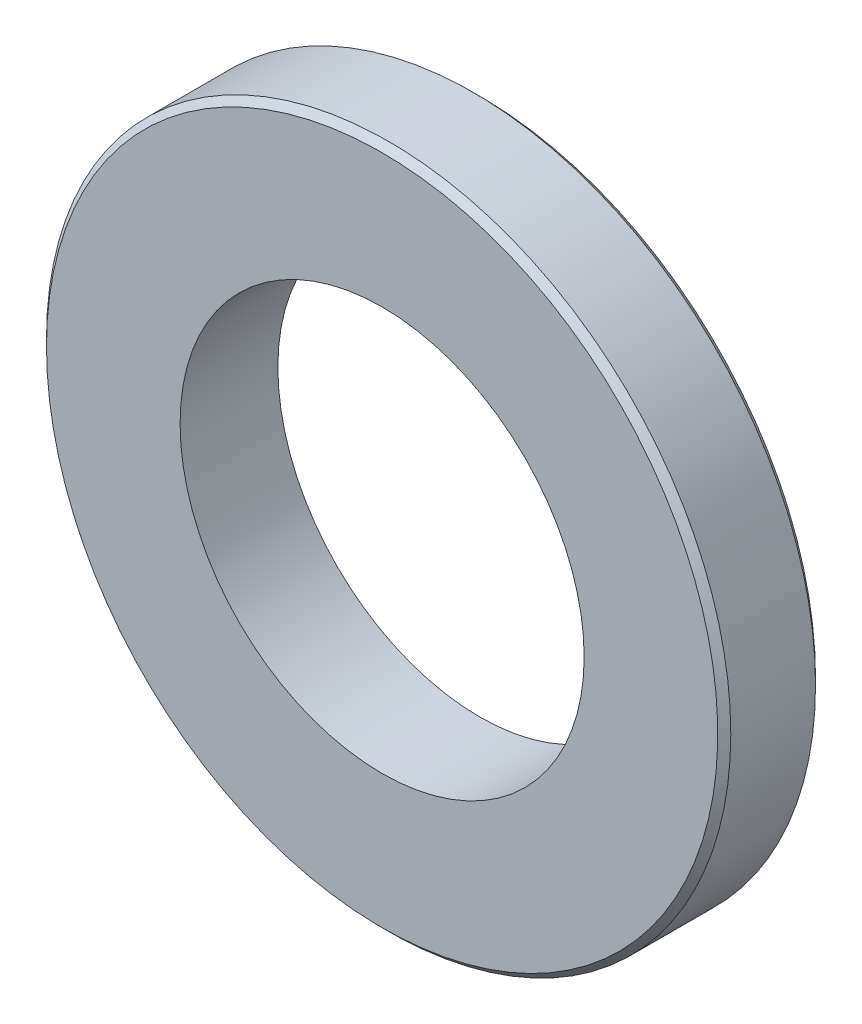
ISO-10303-21;
HEADER;
FILE_DESCRIPTION(('STEP AP214'),'2;1');
FILE_NAME('part.step','',(''),(''),'','','');
FILE_SCHEMA(('AUTOMOTIVE_DESIGN { 1 0 10303 214 1 1 1 1 }'));
ENDSEC;
DATA;
#1=APPLICATION_CONTEXT('core data for automotive mechanical design processes');
#2=APPLICATION_PROTOCOL_DEFINITION('international standard','automotive_design',2000,#1);
#3=PRODUCT_CONTEXT('',#1,'mechanical');
#4=PRODUCT('Part','Part','',(#3));
#5=PRODUCT_RELATED_PRODUCT_CATEGORY('part','',(#4));
#6=PRODUCT_DEFINITION_FORMATION('','',#4);
#7=PRODUCT_DEFINITION_CONTEXT('part definition',#1,'design');
#8=PRODUCT_DEFINITION('design','',#6,#7);
#9=PRODUCT_DEFINITION_SHAPE('','',#8);
#10=(LENGTH_UNIT() NAMED_UNIT(*) SI_UNIT(.MILLI.,.METRE.));
#11=(NAMED_UNIT(*) PLANE_ANGLE_UNIT() SI_UNIT($,.RADIAN.));
#12=(NAMED_UNIT(*) SI_UNIT($,.STERADIAN.) SOLID_ANGLE_UNIT());
#13=UNCERTAINTY_MEASURE_WITH_UNIT(LENGTH_MEASURE(1.E-05),#10,'distance_accuracy_value','');
#14=(GEOMETRIC_REPRESENTATION_CONTEXT(3) GLOBAL_UNCERTAINTY_ASSIGNED_CONTEXT((#13)) GLOBAL_UNIT_ASSIGNED_CONTEXT((#10,
#11,#12)) REPRESENTATION_CONTEXT('',''));
#15=CARTESIAN_POINT('',(0.,0.,0.));
#16=DIRECTION('',(0.,0.,1.));
#17=DIRECTION('',(1.,0.,0.));
#18=AXIS2_PLACEMENT_3D('',#15,#16,#17);
#19=CARTESIAN_POINT('',(0.,6.66133814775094E-13,1.50000000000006));
#20=DIRECTION('',(0.,0.,0.999999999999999));
#21=DIRECTION('',(0.999999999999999,0.,0.));
#22=AXIS2_PLACEMENT_3D('',#19,#20,#21);
#23=PLANE('',#22);
#24=CARTESIAN_POINT('',(0.,6.66133814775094E-13,1.50000000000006));
#25=DIRECTION('',(0.,0.,0.999999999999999));
#26=DIRECTION('',(0.999999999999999,0.,0.));
#27=AXIS2_PLACEMENT_3D('',#24,#25,#26);
#28=CIRCLE('',#27,5.15);
#29=CARTESIAN_POINT('',(-5.14999999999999,6.65847932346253E-13,1.50000000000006));
#30=VERTEX_POINT('',#29);
#31=EDGE_CURVE('E51',#30,#30,#28,.T.);
#32=ORIENTED_EDGE('',*,*,#31,.T.);
#33=EDGE_LOOP('',(#32));
#34=FACE_BOUND('',#33,.T.);
#35=CARTESIAN_POINT('',(0.,6.66133814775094E-13,1.50000000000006));
#36=DIRECTION('',(0.,0.,0.999999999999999));
#37=DIRECTION('',(0.999999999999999,0.,0.));
#38=AXIS2_PLACEMENT_3D('',#35,#36,#37);
#39=CIRCLE('',#38,3.1);
#40=CARTESIAN_POINT('',(-3.1,6.65961730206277E-13,1.50000000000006));
#41=VERTEX_POINT('',#40);
#42=EDGE_CURVE('E56',#41,#41,#39,.T.);
#43=ORIENTED_EDGE('',*,*,#42,.F.);
#44=EDGE_LOOP('',(#43));
#45=FACE_BOUND('',#44,.T.);
#46=ADVANCED_FACE('F36',(#34,#45),#23,.T.);
#47=CARTESIAN_POINT('',(0.,6.66133814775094E-13,0.));
#48=DIRECTION('',(0.,0.,0.999999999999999));
#49=DIRECTION('',(0.999999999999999,0.,0.));
#50=AXIS2_PLACEMENT_3D('',#47,#48,#49);
#51=PLANE('',#50);
#52=CARTESIAN_POINT('',(0.,6.66133814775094E-13,0.));
#53=DIRECTION('',(0.,0.,0.999999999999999));
#54=DIRECTION('',(0.999999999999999,0.,0.));
#55=AXIS2_PLACEMENT_3D('',#52,#53,#54);
#56=CIRCLE('',#55,5.15);
#57=CARTESIAN_POINT('',(5.14999999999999,6.66419697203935E-13,0.));
#58=VERTEX_POINT('',#57);
#59=EDGE_CURVE('E10',#58,#58,#56,.F.);
#60=ORIENTED_EDGE('',*,*,#59,.T.);
#61=EDGE_LOOP('',(#60));
#62=FACE_BOUND('',#61,.T.);
#63=CARTESIAN_POINT('',(0.,6.66133814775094E-13,0.));
#64=DIRECTION('',(0.,0.,0.999999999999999));
#65=DIRECTION('',(0.999999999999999,0.,0.));
#66=AXIS2_PLACEMENT_3D('',#63,#64,#65);
#67=CIRCLE('',#66,3.1);
#68=CARTESIAN_POINT('',(-3.1,6.65961730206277E-13,0.));
#69=VERTEX_POINT('',#68);
#70=EDGE_CURVE('E59',#69,#69,#67,.T.);
#71=ORIENTED_EDGE('',*,*,#70,.T.);
#72=EDGE_LOOP('',(#71));
#73=FACE_BOUND('',#72,.T.);
#74=ADVANCED_FACE('F63',(#62,#73),#51,.F.);
#75=CARTESIAN_POINT('',(0.,6.66133814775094E-13,1.50000000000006));
#76=DIRECTION('',(0.,0.,-0.999999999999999));
#77=DIRECTION('',(-0.999999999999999,0.,0.));
#78=AXIS2_PLACEMENT_3D('',#75,#76,#77);
#79=CYLINDRICAL_SURFACE('',#78,5.25);
#80=CARTESIAN_POINT('',(0.,6.66133814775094E-13,1.40000000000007));
#81=DIRECTION('',(0.,0.,0.999999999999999));
#82=DIRECTION('',(0.999999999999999,0.,0.));
#83=AXIS2_PLACEMENT_3D('',#80,#81,#82);
#84=CIRCLE('',#83,5.25);
#85=CARTESIAN_POINT('',(-5.25,6.6584238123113E-13,1.40000000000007));
#86=VERTEX_POINT('',#85);
#87=EDGE_CURVE('E43',#86,#86,#84,.F.);
#88=CARTESIAN_POINT('',(0.,6.66133814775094E-13,0.099999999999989));
#89=DIRECTION('',(0.,0.,0.999999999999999));
#90=DIRECTION('',(0.999999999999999,0.,0.));
#91=AXIS2_PLACEMENT_3D('',#88,#89,#90);
#92=CIRCLE('',#91,5.25);
#93=CARTESIAN_POINT('',(-5.25,6.6584238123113E-13,0.099999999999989));
#94=VERTEX_POINT('',#93);
#95=EDGE_CURVE('E47',#94,#94,#92,.T.);
#96=CARTESIAN_POINT('',(-5.25,6.6584238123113E-13,1.40000000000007));
#97=CARTESIAN_POINT('',(-5.25,6.6584238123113E-13,1.3864583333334));
#98=CARTESIAN_POINT('',(-5.25,6.6584238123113E-13,1.37291666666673));
#99=CARTESIAN_POINT('',(-5.25,6.6584238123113E-13,1.3458333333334));
#100=CARTESIAN_POINT('',(-5.25,6.6584238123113E-13,1.33229166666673));
#101=CARTESIAN_POINT('',(-5.25,6.6584238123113E-13,1.3052083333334));
#102=CARTESIAN_POINT('',(-5.25,6.6584238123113E-13,1.29166666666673));
#103=CARTESIAN_POINT('',(-5.25,6.6584238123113E-13,1.26458333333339));
#104=CARTESIAN_POINT('',(-5.25,6.6584238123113E-13,1.25104166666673));
#105=CARTESIAN_POINT('',(-5.25,6.6584238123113E-13,1.22395833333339));
#106=CARTESIAN_POINT('',(-5.25,6.6584238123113E-13,1.21041666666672));
#107=CARTESIAN_POINT('',(-5.25,6.6584238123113E-13,1.18333333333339));
#108=CARTESIAN_POINT('',(-5.25,6.6584238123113E-13,1.16979166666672));
#109=CARTESIAN_POINT('',(-5.25,6.6584238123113E-13,1.14270833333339));
#110=CARTESIAN_POINT('',(-5.25,6.6584238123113E-13,1.12916666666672));
#111=CARTESIAN_POINT('',(-5.25,6.6584238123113E-13,1.10208333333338));
#112=CARTESIAN_POINT('',(-5.25,6.6584238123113E-13,1.08854166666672));
#113=CARTESIAN_POINT('',(-5.25,6.6584238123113E-13,1.06145833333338));
#114=CARTESIAN_POINT('',(-5.25,6.6584238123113E-13,1.04791666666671));
#115=CARTESIAN_POINT('',(-5.25,6.6584238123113E-13,1.02083333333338));
#116=CARTESIAN_POINT('',(-5.25,6.6584238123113E-13,1.00729166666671));
#117=CARTESIAN_POINT('',(-5.25,6.6584238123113E-13,0.980208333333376));
#118=CARTESIAN_POINT('',(-5.25,6.6584238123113E-13,0.966666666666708));
#119=CARTESIAN_POINT('',(-5.25,6.6584238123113E-13,0.939583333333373));
#120=CARTESIAN_POINT('',(-5.25,6.6584238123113E-13,0.926041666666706));
#121=CARTESIAN_POINT('',(-5.25,6.6584238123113E-13,0.898958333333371));
#122=CARTESIAN_POINT('',(-5.25,6.6584238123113E-13,0.885416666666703));
#123=CARTESIAN_POINT('',(-5.25,6.6584238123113E-13,0.858333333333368));
#124=CARTESIAN_POINT('',(-5.25,6.6584238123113E-13,0.844791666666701));
#125=CARTESIAN_POINT('',(-5.25,6.6584238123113E-13,0.817708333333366));
#126=CARTESIAN_POINT('',(-5.25,6.6584238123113E-13,0.804166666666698));
#127=CARTESIAN_POINT('',(-5.25,6.6584238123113E-13,0.777083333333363));
#128=CARTESIAN_POINT('',(-5.25,6.6584238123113E-13,0.763541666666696));
#129=CARTESIAN_POINT('',(-5.25,6.6584238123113E-13,0.736458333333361));
#130=CARTESIAN_POINT('',(-5.25,6.6584238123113E-13,0.722916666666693));
#131=CARTESIAN_POINT('',(-5.25,6.6584238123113E-13,0.695833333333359));
#132=CARTESIAN_POINT('',(-5.25,6.6584238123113E-13,0.682291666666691));
#133=CARTESIAN_POINT('',(-5.25,6.6584238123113E-13,0.655208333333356));
#134=CARTESIAN_POINT('',(-5.25,6.6584238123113E-13,0.641666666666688));
#135=CARTESIAN_POINT('',(-5.25,6.6584238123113E-13,0.614583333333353));
#136=CARTESIAN_POINT('',(-5.25,6.6584238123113E-13,0.601041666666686));
#137=CARTESIAN_POINT('',(-5.25,6.6584238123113E-13,0.573958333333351));
#138=CARTESIAN_POINT('',(-5.25,6.6584238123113E-13,0.560416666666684));
#139=CARTESIAN_POINT('',(-5.25,6.6584238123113E-13,0.533333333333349));
#140=CARTESIAN_POINT('',(-5.25,6.6584238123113E-13,0.519791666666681));
#141=CARTESIAN_POINT('',(-5.25,6.6584238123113E-13,0.492708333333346));
#142=CARTESIAN_POINT('',(-5.25,6.6584238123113E-13,0.479166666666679));
#143=CARTESIAN_POINT('',(-5.25,6.6584238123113E-13,0.452083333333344));
#144=CARTESIAN_POINT('',(-5.25,6.6584238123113E-13,0.438541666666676));
#145=CARTESIAN_POINT('',(-5.25,6.6584238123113E-13,0.411458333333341));
#146=CARTESIAN_POINT('',(-5.25,6.6584238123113E-13,0.397916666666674));
#147=CARTESIAN_POINT('',(-5.25,6.6584238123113E-13,0.370833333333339));
#148=CARTESIAN_POINT('',(-5.25,6.6584238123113E-13,0.357291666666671));
#149=CARTESIAN_POINT('',(-5.25,6.6584238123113E-13,0.330208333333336));
#150=CARTESIAN_POINT('',(-5.25,6.6584238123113E-13,0.316666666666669));
#151=CARTESIAN_POINT('',(-5.25,6.6584238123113E-13,0.289583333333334));
#152=CARTESIAN_POINT('',(-5.25,6.6584238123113E-13,0.276041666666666));
#153=CARTESIAN_POINT('',(-5.25,6.6584238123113E-13,0.248958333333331));
#154=CARTESIAN_POINT('',(-5.25,6.6584238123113E-13,0.235416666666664));
#155=CARTESIAN_POINT('',(-5.25,6.6584238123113E-13,0.208333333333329));
#156=CARTESIAN_POINT('',(-5.25,6.6584238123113E-13,0.194791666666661));
#157=CARTESIAN_POINT('',(-5.25,6.6584238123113E-13,0.167708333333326));
#158=CARTESIAN_POINT('',(-5.25,6.6584238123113E-13,0.154166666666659));
#159=CARTESIAN_POINT('',(-5.25,6.6584238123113E-13,0.127083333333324));
#160=CARTESIAN_POINT('',(-5.25,6.6584238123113E-13,0.113541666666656));
#161=CARTESIAN_POINT('',(-5.25,6.6584238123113E-13,0.099999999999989));
#162=B_SPLINE_CURVE_WITH_KNOTS('',3,(#96,#97,#98,#99,#100,#101,#102,#103,#104,#105,#106,#107,
#108,#109,#110,#111,#112,#113,#114,#115,#116,#117,#118,#119,#120,#121,#122,#123,#124,#125,#126,
#127,#128,#129,#130,#131,#132,#133,#134,#135,#136,#137,#138,#139,#140,#141,#142,#143,#144,#145,
#146,#147,#148,#149,#150,#151,#152,#153,#154,#155,#156,#157,#158,#159,#160,#161),.UNSPECIFIED.,
.F.,.F.,(4,2,2,2,2,2,2,2,2,2,2,2,2,2,2,2,2,2,2,2,2,2,2,2,2,2,2,2,2,2,2,2,4),(0.,
0.0406250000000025,0.0812500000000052,0.121875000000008,0.16250000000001,0.203125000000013,
0.243750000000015,0.284375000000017,0.32500000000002,0.365625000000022,0.406250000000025,
0.446875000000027,0.48750000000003,0.528125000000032,0.568750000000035,0.609375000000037,
0.65000000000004,0.690625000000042,0.731250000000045,0.771875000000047,0.81250000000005,
0.853125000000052,0.893750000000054,0.934375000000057,0.975000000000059,1.01562500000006,
1.05625000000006,1.09687500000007,1.13750000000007,1.17812500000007,1.21875000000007,
1.25937500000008,1.30000000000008),.UNSPECIFIED.);
#163=EDGE_CURVE('BSEAM38',#86,#94,#162,.T.);
#164=ORIENTED_EDGE('',*,*,#87,.T.);
#165=ORIENTED_EDGE('',*,*,#95,.T.);
#166=ORIENTED_EDGE('',*,*,#163,.T.);
#167=ORIENTED_EDGE('',*,*,#163,.F.);
#168=EDGE_LOOP('',(#164,#166,#165,#167));
#169=FACE_BOUND('',#168,.T.);
#170=ADVANCED_FACE('F38',(#169),#79,.T.);
#171=CARTESIAN_POINT('',(0.,6.66133814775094E-13,1.50000000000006));
#172=DIRECTION('',(0.,0.,-0.999999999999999));
#173=DIRECTION('',(-0.999999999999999,0.,0.));
#174=AXIS2_PLACEMENT_3D('',#171,#172,#173);
#175=CYLINDRICAL_SURFACE('',#174,3.1);
#176=CARTESIAN_POINT('',(-3.1,6.65961730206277E-13,1.50000000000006));
#177=CARTESIAN_POINT('',(-3.1,6.65961730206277E-13,1.48437500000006));
#178=CARTESIAN_POINT('',(-3.1,6.65961730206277E-13,1.46875000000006));
#179=CARTESIAN_POINT('',(-3.1,6.65961730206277E-13,1.43750000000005));
#180=CARTESIAN_POINT('',(-3.1,6.65961730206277E-13,1.42187500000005));
#181=CARTESIAN_POINT('',(-3.1,6.65961730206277E-13,1.39062500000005));
#182=CARTESIAN_POINT('',(-3.1,6.65961730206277E-13,1.37500000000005));
#183=CARTESIAN_POINT('',(-3.1,6.65961730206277E-13,1.34375000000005));
#184=CARTESIAN_POINT('',(-3.1,6.65961730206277E-13,1.32812500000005));
#185=CARTESIAN_POINT('',(-3.1,6.65961730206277E-13,1.29687500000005));
#186=CARTESIAN_POINT('',(-3.1,6.65961730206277E-13,1.28125000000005));
#187=CARTESIAN_POINT('',(-3.1,6.65961730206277E-13,1.25000000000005));
#188=CARTESIAN_POINT('',(-3.1,6.65961730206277E-13,1.23437500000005));
#189=CARTESIAN_POINT('',(-3.1,6.65961730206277E-13,1.20312500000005));
#190=CARTESIAN_POINT('',(-3.1,6.65961730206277E-13,1.18750000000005));
#191=CARTESIAN_POINT('',(-3.1,6.65961730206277E-13,1.15625000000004));
#192=CARTESIAN_POINT('',(-3.1,6.65961730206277E-13,1.14062500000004));
#193=CARTESIAN_POINT('',(-3.1,6.65961730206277E-13,1.10937500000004));
#194=CARTESIAN_POINT('',(-3.1,6.65961730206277E-13,1.09375000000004));
#195=CARTESIAN_POINT('',(-3.1,6.65961730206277E-13,1.06250000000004));
#196=CARTESIAN_POINT('',(-3.1,6.65961730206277E-13,1.04687500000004));
#197=CARTESIAN_POINT('',(-3.1,6.65961730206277E-13,1.01562500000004));
#198=CARTESIAN_POINT('',(-3.1,6.65961730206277E-13,1.00000000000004));
#199=CARTESIAN_POINT('',(-3.1,6.65961730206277E-13,0.968750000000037));
#200=CARTESIAN_POINT('',(-3.1,6.65961730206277E-13,0.953125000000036));
#201=CARTESIAN_POINT('',(-3.1,6.65961730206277E-13,0.921875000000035));
#202=CARTESIAN_POINT('',(-3.1,6.65961730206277E-13,0.906250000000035));
#203=CARTESIAN_POINT('',(-3.1,6.65961730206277E-13,0.875000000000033));
#204=CARTESIAN_POINT('',(-3.1,6.65961730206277E-13,0.859375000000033));
#205=CARTESIAN_POINT('',(-3.1,6.65961730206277E-13,0.828125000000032));
#206=CARTESIAN_POINT('',(-3.1,6.65961730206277E-13,0.812500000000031));
#207=CARTESIAN_POINT('',(-3.1,6.65961730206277E-13,0.78125000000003));
#208=CARTESIAN_POINT('',(-3.1,6.65961730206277E-13,0.765625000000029));
#209=CARTESIAN_POINT('',(-3.1,6.65961730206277E-13,0.734375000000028));
#210=CARTESIAN_POINT('',(-3.1,6.65961730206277E-13,0.718750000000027));
#211=CARTESIAN_POINT('',(-3.1,6.65961730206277E-13,0.687500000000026));
#212=CARTESIAN_POINT('',(-3.1,6.65961730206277E-13,0.671875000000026));
#213=CARTESIAN_POINT('',(-3.1,6.65961730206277E-13,0.640625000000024));
#214=CARTESIAN_POINT('',(-3.1,6.65961730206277E-13,0.625000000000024));
#215=CARTESIAN_POINT('',(-3.1,6.65961730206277E-13,0.593750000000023));
#216=CARTESIAN_POINT('',(-3.1,6.65961730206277E-13,0.578125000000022));
#217=CARTESIAN_POINT('',(-3.1,6.65961730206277E-13,0.546875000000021));
#218=CARTESIAN_POINT('',(-3.1,6.65961730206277E-13,0.53125000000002));
#219=CARTESIAN_POINT('',(-3.1,6.65961730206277E-13,0.500000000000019));
#220=CARTESIAN_POINT('',(-3.1,6.65961730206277E-13,0.484375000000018));
#221=CARTESIAN_POINT('',(-3.1,6.65961730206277E-13,0.453125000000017));
#222=CARTESIAN_POINT('',(-3.1,6.65961730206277E-13,0.437500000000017));
#223=CARTESIAN_POINT('',(-3.1,6.65961730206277E-13,0.406250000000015));
#224=CARTESIAN_POINT('',(-3.1,6.65961730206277E-13,0.390625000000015));
#225=CARTESIAN_POINT('',(-3.1,6.65961730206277E-13,0.359375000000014));
#226=CARTESIAN_POINT('',(-3.1,6.65961730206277E-13,0.343750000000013));
#227=CARTESIAN_POINT('',(-3.1,6.65961730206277E-13,0.312500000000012));
#228=CARTESIAN_POINT('',(-3.1,6.65961730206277E-13,0.296875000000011));
#229=CARTESIAN_POINT('',(-3.1,6.65961730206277E-13,0.26562500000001));
#230=CARTESIAN_POINT('',(-3.1,6.65961730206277E-13,0.250000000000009));
#231=CARTESIAN_POINT('',(-3.1,6.65961730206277E-13,0.218750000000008));
#232=CARTESIAN_POINT('',(-3.1,6.65961730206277E-13,0.203125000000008));
#233=CARTESIAN_POINT('',(-3.1,6.65961730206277E-13,0.171875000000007));
#234=CARTESIAN_POINT('',(-3.1,6.65961730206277E-13,0.156250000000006));
#235=CARTESIAN_POINT('',(-3.1,6.65961730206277E-13,0.125000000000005));
#236=CARTESIAN_POINT('',(-3.1,6.65961730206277E-13,0.109375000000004));
#237=CARTESIAN_POINT('',(-3.1,6.65961730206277E-13,0.078125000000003));
#238=CARTESIAN_POINT('',(-3.1,6.65961730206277E-13,0.0625000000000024));
#239=CARTESIAN_POINT('',(-3.1,6.65961730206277E-13,0.0312500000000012));
#240=CARTESIAN_POINT('',(-3.1,6.65961730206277E-13,0.0156250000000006));
#241=CARTESIAN_POINT('',(-3.1,6.65961730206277E-13,0.));
#242=B_SPLINE_CURVE_WITH_KNOTS('',3,(#176,#177,#178,#179,#180,#181,#182,#183,#184,#185,#186,
#187,#188,#189,#190,#191,#192,#193,#194,#195,#196,#197,#198,#199,#200,#201,#202,#203,#204,#205,
#206,#207,#208,#209,#210,#211,#212,#213,#214,#215,#216,#217,#218,#219,#220,#221,#222,#223,#224,
#225,#226,#227,#228,#229,#230,#231,#232,#233,#234,#235,#236,#237,#238,#239,#240,#241),
.UNSPECIFIED.,.F.,.F.,(4,2,2,2,2,2,2,2,2,2,2,2,2,2,2,2,2,2,2,2,2,2,2,2,2,2,2,2,2,2,2,2,4),(0.,
0.0468750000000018,0.0937500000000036,0.140625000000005,0.187500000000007,0.234375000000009,
0.28125000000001,0.328125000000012,0.375000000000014,0.421875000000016,0.468750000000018,
0.51562500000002,0.562500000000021,0.609375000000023,0.656250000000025,0.703125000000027,
0.750000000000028,0.79687500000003,0.843750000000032,0.890625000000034,0.937500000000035,
0.984375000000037,1.03125000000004,1.07812500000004,1.12500000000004,1.17187500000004,
1.21875000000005,1.26562500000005,1.31250000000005,1.35937500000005,1.40625000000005,
1.45312500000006,1.50000000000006),.UNSPECIFIED.);
#243=EDGE_CURVE('BSEAM65',#41,#69,#242,.T.);
#244=ORIENTED_EDGE('',*,*,#42,.T.);
#245=ORIENTED_EDGE('',*,*,#70,.F.);
#246=ORIENTED_EDGE('',*,*,#243,.T.);
#247=ORIENTED_EDGE('',*,*,#243,.F.);
#248=EDGE_LOOP('',(#244,#246,#245,#247));
#249=FACE_BOUND('',#248,.T.);
#250=ADVANCED_FACE('F65',(#249),#175,.F.);
#251=CARTESIAN_POINT('',(0.,6.66133814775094E-13,1.50000000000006));
#252=DIRECTION('',(0.,0.,-0.999999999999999));
#253=DIRECTION('',(-0.999999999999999,0.,0.));
#254=AXIS2_PLACEMENT_3D('',#251,#252,#253);
#255=CONICAL_SURFACE('',#254,5.15,0.785398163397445);
#256=CARTESIAN_POINT('',(-5.24999999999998,6.6584238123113E-13,1.40000000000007));
#257=CARTESIAN_POINT('',(-5.24895833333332,6.65842439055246E-13,1.40104166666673));
#258=CARTESIAN_POINT('',(-5.24791666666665,6.65842496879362E-13,1.4020833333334));
#259=CARTESIAN_POINT('',(-5.24583333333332,6.65842612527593E-13,1.40416666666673));
#260=CARTESIAN_POINT('',(-5.24479166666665,6.65842670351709E-13,1.4052083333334));
#261=CARTESIAN_POINT('',(-5.24270833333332,6.65842785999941E-13,1.40729166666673));
#262=CARTESIAN_POINT('',(-5.24166666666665,6.65842843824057E-13,1.4083333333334));
#263=CARTESIAN_POINT('',(-5.23958333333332,6.65842959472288E-13,1.41041666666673));
#264=CARTESIAN_POINT('',(-5.23854166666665,6.65843017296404E-13,1.4114583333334));
#265=CARTESIAN_POINT('',(-5.23645833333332,6.65843132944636E-13,1.41354166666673));
#266=CARTESIAN_POINT('',(-5.23541666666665,6.65843190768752E-13,1.4145833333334));
#267=CARTESIAN_POINT('',(-5.23333333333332,6.65843306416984E-13,1.41666666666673));
#268=CARTESIAN_POINT('',(-5.23229166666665,6.658433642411E-13,1.4177083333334));
#269=CARTESIAN_POINT('',(-5.23020833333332,6.65843479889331E-13,1.41979166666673));
#270=CARTESIAN_POINT('',(-5.22916666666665,6.65843537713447E-13,1.4208333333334));
#271=CARTESIAN_POINT('',(-5.22708333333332,6.65843653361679E-13,1.42291666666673));
#272=CARTESIAN_POINT('',(-5.22604166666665,6.65843711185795E-13,1.4239583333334));
#273=CARTESIAN_POINT('',(-5.22395833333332,6.65843826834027E-13,1.42604166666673));
#274=CARTESIAN_POINT('',(-5.22291666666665,6.65843884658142E-13,1.4270833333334));
#275=CARTESIAN_POINT('',(-5.22083333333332,6.65844000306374E-13,1.42916666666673));
#276=CARTESIAN_POINT('',(-5.21979166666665,6.6584405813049E-13,1.4302083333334));
#277=CARTESIAN_POINT('',(-5.21770833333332,6.65844173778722E-13,1.43229166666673));
#278=CARTESIAN_POINT('',(-5.21666666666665,6.65844231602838E-13,1.4333333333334));
#279=CARTESIAN_POINT('',(-5.21458333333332,6.65844347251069E-13,1.43541666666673));
#280=CARTESIAN_POINT('',(-5.21354166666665,6.65844405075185E-13,1.4364583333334));
#281=CARTESIAN_POINT('',(-5.21145833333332,6.65844520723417E-13,1.43854166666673));
#282=CARTESIAN_POINT('',(-5.21041666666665,6.65844578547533E-13,1.4395833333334));
#283=CARTESIAN_POINT('',(-5.20833333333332,6.65844694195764E-13,1.44166666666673));
#284=CARTESIAN_POINT('',(-5.20729166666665,6.6584475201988E-13,1.4427083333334));
#285=CARTESIAN_POINT('',(-5.20520833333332,6.65844867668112E-13,1.44479166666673));
#286=CARTESIAN_POINT('',(-5.20416666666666,6.65844925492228E-13,1.4458333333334));
#287=CARTESIAN_POINT('',(-5.20208333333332,6.6584504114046E-13,1.44791666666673));
#288=CARTESIAN_POINT('',(-5.20104166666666,6.65845098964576E-13,1.4489583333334));
#289=CARTESIAN_POINT('',(-5.19895833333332,6.65845214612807E-13,1.45104166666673));
#290=CARTESIAN_POINT('',(-5.19791666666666,6.65845272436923E-13,1.4520833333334));
#291=CARTESIAN_POINT('',(-5.19583333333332,6.65845388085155E-13,1.45416666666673));
#292=CARTESIAN_POINT('',(-5.19479166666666,6.65845445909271E-13,1.4552083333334));
#293=CARTESIAN_POINT('',(-5.19270833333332,6.65845561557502E-13,1.45729166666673));
#294=CARTESIAN_POINT('',(-5.19166666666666,6.65845619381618E-13,1.45833333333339));
#295=CARTESIAN_POINT('',(-5.18958333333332,6.6584573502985E-13,1.46041666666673));
#296=CARTESIAN_POINT('',(-5.18854166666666,6.65845792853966E-13,1.46145833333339));
#297=CARTESIAN_POINT('',(-5.18645833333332,6.65845908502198E-13,1.46354166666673));
#298=CARTESIAN_POINT('',(-5.18541666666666,6.65845966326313E-13,1.46458333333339));
#299=CARTESIAN_POINT('',(-5.18333333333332,6.65846081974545E-13,1.46666666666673));
#300=CARTESIAN_POINT('',(-5.18229166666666,6.65846139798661E-13,1.46770833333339));
#301=CARTESIAN_POINT('',(-5.18020833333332,6.65846255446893E-13,1.46979166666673));
#302=CARTESIAN_POINT('',(-5.17916666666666,6.65846313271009E-13,1.47083333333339));
#303=CARTESIAN_POINT('',(-5.17708333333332,6.65846428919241E-13,1.47291666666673));
#304=CARTESIAN_POINT('',(-5.17604166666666,6.65846486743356E-13,1.47395833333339));
#305=CARTESIAN_POINT('',(-5.17395833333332,6.65846602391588E-13,1.47604166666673));
#306=CARTESIAN_POINT('',(-5.17291666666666,6.65846660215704E-13,1.47708333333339));
#307=CARTESIAN_POINT('',(-5.17083333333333,6.65846775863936E-13,1.47916666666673));
#308=CARTESIAN_POINT('',(-5.16979166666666,6.65846833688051E-13,1.48020833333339));
#309=CARTESIAN_POINT('',(-5.16770833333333,6.65846949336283E-13,1.48229166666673));
#310=CARTESIAN_POINT('',(-5.16666666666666,6.65847007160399E-13,1.48333333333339));
#311=CARTESIAN_POINT('',(-5.16458333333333,6.65847122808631E-13,1.48541666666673));
#312=CARTESIAN_POINT('',(-5.16354166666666,6.65847180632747E-13,1.48645833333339));
#313=CARTESIAN_POINT('',(-5.16145833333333,6.65847296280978E-13,1.48854166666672));
#314=CARTESIAN_POINT('',(-5.16041666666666,6.65847354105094E-13,1.48958333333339));
#315=CARTESIAN_POINT('',(-5.15833333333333,6.65847469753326E-13,1.49166666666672));
#316=CARTESIAN_POINT('',(-5.15729166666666,6.65847527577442E-13,1.49270833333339));
#317=CARTESIAN_POINT('',(-5.15520833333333,6.65847643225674E-13,1.49479166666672));
#318=CARTESIAN_POINT('',(-5.15416666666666,6.65847701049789E-13,1.49583333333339));
#319=CARTESIAN_POINT('',(-5.15208333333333,6.65847816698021E-13,1.49791666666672));
#320=CARTESIAN_POINT('',(-5.15104166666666,6.65847874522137E-13,1.49895833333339));
#321=CARTESIAN_POINT('',(-5.14999999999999,6.65847932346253E-13,1.50000000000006));
#322=B_SPLINE_CURVE_WITH_KNOTS('',3,(#256,#257,#258,#259,#260,#261,#262,#263,#264,#265,#266,
#267,#268,#269,#270,#271,#272,#273,#274,#275,#276,#277,#278,#279,#280,#281,#282,#283,#284,#285,
#286,#287,#288,#289,#290,#291,#292,#293,#294,#295,#296,#297,#298,#299,#300,#301,#302,#303,#304,
#305,#306,#307,#308,#309,#310,#311,#312,#313,#314,#315,#316,#317,#318,#319,#320,#321),
.UNSPECIFIED.,.F.,.F.,(4,2,2,2,2,2,2,2,2,2,2,2,2,2,2,2,2,2,2,2,2,2,2,2,2,2,2,2,2,2,2,2,4),(0.,
0.00441941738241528,0.00883883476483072,0.0132582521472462,0.0176776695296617,
0.0220970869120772,0.0265165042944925,0.0309359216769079,0.0353553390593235,0.0397747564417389,
0.0441941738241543,0.0486135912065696,0.0530330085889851,0.0574524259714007,0.0618718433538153,
0.0662912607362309,0.0707106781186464,0.0751300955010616,0.0795495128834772,0.0839689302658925,
0.0883883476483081,0.0928077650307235,0.0972271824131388,0.101646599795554,0.10606601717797,
0.110485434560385,0.114904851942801,0.119324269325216,0.123743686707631,0.128163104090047,
0.132582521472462,0.137001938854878,0.141421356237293),.UNSPECIFIED.);
#323=EDGE_CURVE('BSEAM67',#86,#30,#322,.T.);
#324=ORIENTED_EDGE('',*,*,#87,.F.);
#325=ORIENTED_EDGE('',*,*,#31,.F.);
#326=ORIENTED_EDGE('',*,*,#323,.T.);
#327=ORIENTED_EDGE('',*,*,#323,.F.);
#328=EDGE_LOOP('',(#324,#326,#325,#327));
#329=FACE_BOUND('',#328,.T.);
#330=ADVANCED_FACE('F67',(#329),#255,.T.);
#331=CARTESIAN_POINT('',(0.,6.66133814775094E-13,0.099999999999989));
#332=DIRECTION('',(0.,0.,0.999999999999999));
#333=DIRECTION('',(0.999999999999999,0.,0.));
#334=AXIS2_PLACEMENT_3D('',#331,#332,#333);
#335=CONICAL_SURFACE('',#334,5.25,0.785398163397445);
#336=ORIENTED_EDGE('',*,*,#59,.F.);
#337=EDGE_LOOP('',(#336));
#338=FACE_BOUND('',#337,.T.);
#339=ORIENTED_EDGE('',*,*,#95,.F.);
#340=EDGE_LOOP('',(#339));
#341=FACE_BOUND('',#340,.T.);
#342=ADVANCED_FACE('F74',(#338,#341),#335,.T.);
#343=CLOSED_SHELL('',(#46,#74,#170,#250,#330,#342));
#344=MANIFOLD_SOLID_BREP('B2',#343);
#345=ADVANCED_BREP_SHAPE_REPRESENTATION('',(#18,#344),#14);
#346=SHAPE_DEFINITION_REPRESENTATION(#9,#345);
ENDSEC;
END-ISO-10303-21;
